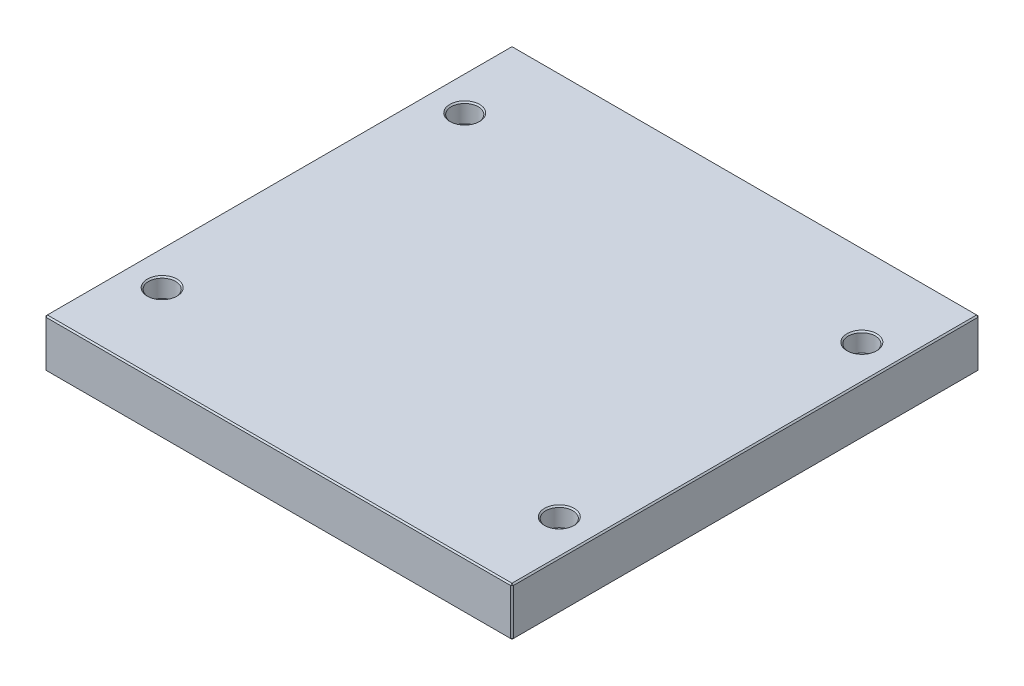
ISO-10303-21;
HEADER;
FILE_DESCRIPTION(('STEP AP214'),'2;1');
FILE_NAME('part.step','',(''),(''),'','','');
FILE_SCHEMA(('AUTOMOTIVE_DESIGN { 1 0 10303 214 1 1 1 1 }'));
ENDSEC;
DATA;
#1=APPLICATION_CONTEXT('core data for automotive mechanical design processes');
#2=APPLICATION_PROTOCOL_DEFINITION('international standard','automotive_design',2000,#1);
#3=PRODUCT_CONTEXT('',#1,'mechanical');
#4=PRODUCT('Part','Part','',(#3));
#5=PRODUCT_RELATED_PRODUCT_CATEGORY('part','',(#4));
#6=PRODUCT_DEFINITION_FORMATION('','',#4);
#7=PRODUCT_DEFINITION_CONTEXT('part definition',#1,'design');
#8=PRODUCT_DEFINITION('design','',#6,#7);
#9=PRODUCT_DEFINITION_SHAPE('','',#8);
#10=(LENGTH_UNIT() NAMED_UNIT(*) SI_UNIT(.MILLI.,.METRE.));
#11=(NAMED_UNIT(*) PLANE_ANGLE_UNIT() SI_UNIT($,.RADIAN.));
#12=(NAMED_UNIT(*) SI_UNIT($,.STERADIAN.) SOLID_ANGLE_UNIT());
#13=UNCERTAINTY_MEASURE_WITH_UNIT(LENGTH_MEASURE(1.E-05),#10,'distance_accuracy_value','');
#14=(GEOMETRIC_REPRESENTATION_CONTEXT(3) GLOBAL_UNCERTAINTY_ASSIGNED_CONTEXT((#13)) GLOBAL_UNIT_ASSIGNED_CONTEXT((#10,
#11,#12)) REPRESENTATION_CONTEXT('',''));
#15=CARTESIAN_POINT('',(0.,0.,0.));
#16=DIRECTION('',(0.,0.,1.));
#17=DIRECTION('',(1.,0.,0.));
#18=AXIS2_PLACEMENT_3D('',#15,#16,#17);
#19=CARTESIAN_POINT('',(-173.,36.,173.));
#20=DIRECTION('',(1.,0.,0.));
#21=DIRECTION('',(0.,0.,-1.));
#22=AXIS2_PLACEMENT_3D('',#19,#20,#21);
#23=PLANE('',#22);
#24=DIRECTION('',(0.,-1.,0.));
#25=VECTOR('',#24,1.);
#26=CARTESIAN_POINT('',(-173.,36.,-172.));
#27=LINE('',#26,#25);
#28=CARTESIAN_POINT('',(-173.,35.,-172.));
#29=VERTEX_POINT('',#28);
#30=CARTESIAN_POINT('',(-173.,1.,-172.));
#31=VERTEX_POINT('',#30);
#32=EDGE_CURVE('E117',#29,#31,#27,.T.);
#33=ORIENTED_EDGE('',*,*,#32,.T.);
#34=DIRECTION('',(0.,0.,1.));
#35=VECTOR('',#34,1.);
#36=CARTESIAN_POINT('',(-173.,1.,173.));
#37=LINE('',#36,#35);
#38=CARTESIAN_POINT('',(-173.,1.,172.));
#39=VERTEX_POINT('',#38);
#40=EDGE_CURVE('E112',#31,#39,#37,.T.);
#41=ORIENTED_EDGE('',*,*,#40,.T.);
#42=DIRECTION('',(0.,1.,0.));
#43=VECTOR('',#42,1.);
#44=CARTESIAN_POINT('',(-173.,36.,172.));
#45=LINE('',#44,#43);
#46=CARTESIAN_POINT('',(-173.,35.,172.));
#47=VERTEX_POINT('',#46);
#48=EDGE_CURVE('E105',#39,#47,#45,.T.);
#49=ORIENTED_EDGE('',*,*,#48,.T.);
#50=DIRECTION('',(0.,0.,-1.));
#51=VECTOR('',#50,1.);
#52=CARTESIAN_POINT('',(-173.,35.,-173.));
#53=LINE('',#52,#51);
#54=EDGE_CURVE('E109',#47,#29,#53,.T.);
#55=ORIENTED_EDGE('',*,*,#54,.T.);
#56=EDGE_LOOP('',(#33,#41,#49,#55));
#57=FACE_BOUND('',#56,.T.);
#58=ADVANCED_FACE('F16',(#57),#23,.F.);
#59=CARTESIAN_POINT('',(173.,36.,173.));
#60=DIRECTION('',(0.,0.,-1.));
#61=DIRECTION('',(-1.,0.,0.));
#62=AXIS2_PLACEMENT_3D('',#59,#60,#61);
#63=PLANE('',#62);
#64=DIRECTION('',(-1.,0.,0.));
#65=VECTOR('',#64,1.);
#66=CARTESIAN_POINT('',(-173.,35.,173.));
#67=LINE('',#66,#65);
#68=CARTESIAN_POINT('',(172.,35.,173.));
#69=VERTEX_POINT('',#68);
#70=CARTESIAN_POINT('',(-172.,35.,173.));
#71=VERTEX_POINT('',#70);
#72=EDGE_CURVE('E189',#69,#71,#67,.T.);
#73=ORIENTED_EDGE('',*,*,#72,.T.);
#74=DIRECTION('',(0.,-1.,0.));
#75=VECTOR('',#74,1.);
#76=CARTESIAN_POINT('',(-172.,36.,173.));
#77=LINE('',#76,#75);
#78=CARTESIAN_POINT('',(-172.,1.,173.));
#79=VERTEX_POINT('',#78);
#80=EDGE_CURVE('E125',#71,#79,#77,.T.);
#81=ORIENTED_EDGE('',*,*,#80,.T.);
#82=DIRECTION('',(1.,0.,0.));
#83=VECTOR('',#82,1.);
#84=CARTESIAN_POINT('',(173.,1.,173.));
#85=LINE('',#84,#83);
#86=CARTESIAN_POINT('',(172.,1.,173.));
#87=VERTEX_POINT('',#86);
#88=EDGE_CURVE('E195',#79,#87,#85,.T.);
#89=ORIENTED_EDGE('',*,*,#88,.T.);
#90=DIRECTION('',(0.,1.,0.));
#91=VECTOR('',#90,1.);
#92=CARTESIAN_POINT('',(172.,36.,173.));
#93=LINE('',#92,#91);
#94=EDGE_CURVE('E192',#87,#69,#93,.T.);
#95=ORIENTED_EDGE('',*,*,#94,.T.);
#96=EDGE_LOOP('',(#73,#81,#89,#95));
#97=FACE_BOUND('',#96,.T.);
#98=ADVANCED_FACE('F385',(#97),#63,.F.);
#99=CARTESIAN_POINT('',(173.,36.,173.));
#100=DIRECTION('',(-1.,0.,0.));
#101=DIRECTION('',(0.,0.,1.));
#102=AXIS2_PLACEMENT_3D('',#99,#100,#101);
#103=PLANE('',#102);
#104=DIRECTION('',(0.,0.,-1.));
#105=VECTOR('',#104,1.);
#106=CARTESIAN_POINT('',(173.,1.,173.));
#107=LINE('',#106,#105);
#108=CARTESIAN_POINT('',(173.,1.,172.));
#109=VERTEX_POINT('',#108);
#110=CARTESIAN_POINT('',(173.,1.,-172.));
#111=VERTEX_POINT('',#110);
#112=EDGE_CURVE('E182',#109,#111,#107,.T.);
#113=ORIENTED_EDGE('',*,*,#112,.T.);
#114=DIRECTION('',(0.,1.,0.));
#115=VECTOR('',#114,1.);
#116=CARTESIAN_POINT('',(173.,36.,-172.));
#117=LINE('',#116,#115);
#118=CARTESIAN_POINT('',(173.,35.,-172.));
#119=VERTEX_POINT('',#118);
#120=EDGE_CURVE('E185',#111,#119,#117,.T.);
#121=ORIENTED_EDGE('',*,*,#120,.T.);
#122=DIRECTION('',(0.,0.,1.));
#123=VECTOR('',#122,1.);
#124=CARTESIAN_POINT('',(173.,35.,173.));
#125=LINE('',#124,#123);
#126=CARTESIAN_POINT('',(173.,35.,172.));
#127=VERTEX_POINT('',#126);
#128=EDGE_CURVE('E176',#119,#127,#125,.T.);
#129=ORIENTED_EDGE('',*,*,#128,.T.);
#130=DIRECTION('',(0.,-1.,0.));
#131=VECTOR('',#130,1.);
#132=CARTESIAN_POINT('',(173.,36.,172.));
#133=LINE('',#132,#131);
#134=EDGE_CURVE('E179',#127,#109,#133,.T.);
#135=ORIENTED_EDGE('',*,*,#134,.T.);
#136=EDGE_LOOP('',(#113,#121,#129,#135));
#137=FACE_BOUND('',#136,.T.);
#138=ADVANCED_FACE('F389',(#137),#103,.F.);
#139=CARTESIAN_POINT('',(173.,36.,-173.));
#140=DIRECTION('',(0.,0.,1.));
#141=DIRECTION('',(1.,0.,0.));
#142=AXIS2_PLACEMENT_3D('',#139,#140,#141);
#143=PLANE('',#142);
#144=DIRECTION('',(0.,-1.,0.));
#145=VECTOR('',#144,1.);
#146=CARTESIAN_POINT('',(172.,36.,-173.));
#147=LINE('',#146,#145);
#148=CARTESIAN_POINT('',(172.,35.,-173.));
#149=VERTEX_POINT('',#148);
#150=CARTESIAN_POINT('',(172.,1.,-173.));
#151=VERTEX_POINT('',#150);
#152=EDGE_CURVE('E166',#149,#151,#147,.T.);
#153=ORIENTED_EDGE('',*,*,#152,.T.);
#154=DIRECTION('',(-1.,0.,0.));
#155=VECTOR('',#154,1.);
#156=CARTESIAN_POINT('',(173.,1.,-173.));
#157=LINE('',#156,#155);
#158=CARTESIAN_POINT('',(-172.,1.,-173.));
#159=VERTEX_POINT('',#158);
#160=EDGE_CURVE('E173',#151,#159,#157,.T.);
#161=ORIENTED_EDGE('',*,*,#160,.T.);
#162=DIRECTION('',(0.,1.,0.));
#163=VECTOR('',#162,1.);
#164=CARTESIAN_POINT('',(-172.,36.,-173.));
#165=LINE('',#164,#163);
#166=CARTESIAN_POINT('',(-172.,35.,-173.));
#167=VERTEX_POINT('',#166);
#168=EDGE_CURVE('E169',#159,#167,#165,.T.);
#169=ORIENTED_EDGE('',*,*,#168,.T.);
#170=DIRECTION('',(1.,0.,0.));
#171=VECTOR('',#170,1.);
#172=CARTESIAN_POINT('',(173.,35.,-173.));
#173=LINE('',#172,#171);
#174=EDGE_CURVE('E163',#167,#149,#173,.T.);
#175=ORIENTED_EDGE('',*,*,#174,.T.);
#176=EDGE_LOOP('',(#153,#161,#169,#175));
#177=FACE_BOUND('',#176,.T.);
#178=ADVANCED_FACE('F530',(#177),#143,.F.);
#179=CARTESIAN_POINT('',(0.,36.,0.));
#180=DIRECTION('',(0.,1.,0.));
#181=DIRECTION('',(0.,0.,1.));
#182=AXIS2_PLACEMENT_3D('',#179,#180,#181);
#183=PLANE('',#182);
#184=CARTESIAN_POINT('',(-147.,36.,112.));
#185=DIRECTION('',(0.,1.,0.));
#186=DIRECTION('',(0.,0.,1.));
#187=AXIS2_PLACEMENT_3D('',#184,#185,#186);
#188=CIRCLE('',#187,11.);
#189=CARTESIAN_POINT('',(-147.,36.,123.));
#190=VERTEX_POINT('',#189);
#191=EDGE_CURVE('E358',#190,#190,#188,.F.);
#192=ORIENTED_EDGE('',*,*,#191,.T.);
#193=EDGE_LOOP('',(#192));
#194=FACE_BOUND('',#193,.T.);
#195=CARTESIAN_POINT('',(147.,36.,112.));
#196=DIRECTION('',(0.,1.,0.));
#197=DIRECTION('',(0.,0.,1.));
#198=AXIS2_PLACEMENT_3D('',#195,#196,#197);
#199=CIRCLE('',#198,11.);
#200=CARTESIAN_POINT('',(147.,36.,123.));
#201=VERTEX_POINT('',#200);
#202=EDGE_CURVE('E354',#201,#201,#199,.F.);
#203=ORIENTED_EDGE('',*,*,#202,.T.);
#204=EDGE_LOOP('',(#203));
#205=FACE_BOUND('',#204,.T.);
#206=CARTESIAN_POINT('',(147.,36.,-112.));
#207=DIRECTION('',(0.,1.,0.));
#208=DIRECTION('',(0.,0.,1.));
#209=AXIS2_PLACEMENT_3D('',#206,#207,#208);
#210=CIRCLE('',#209,11.);
#211=CARTESIAN_POINT('',(147.,36.,-101.));
#212=VERTEX_POINT('',#211);
#213=EDGE_CURVE('E350',#212,#212,#210,.F.);
#214=ORIENTED_EDGE('',*,*,#213,.T.);
#215=EDGE_LOOP('',(#214));
#216=FACE_BOUND('',#215,.T.);
#217=CARTESIAN_POINT('',(-147.,36.,-112.));
#218=DIRECTION('',(0.,1.,0.));
#219=DIRECTION('',(0.,0.,1.));
#220=AXIS2_PLACEMENT_3D('',#217,#218,#219);
#221=CIRCLE('',#220,11.);
#222=CARTESIAN_POINT('',(-147.,36.,-101.));
#223=VERTEX_POINT('',#222);
#224=EDGE_CURVE('E346',#223,#223,#221,.F.);
#225=ORIENTED_EDGE('',*,*,#224,.T.);
#226=EDGE_LOOP('',(#225));
#227=FACE_BOUND('',#226,.T.);
#228=DIRECTION('',(0.,0.,-1.));
#229=VECTOR('',#228,1.);
#230=CARTESIAN_POINT('',(172.,36.,-173.));
#231=LINE('',#230,#229);
#232=CARTESIAN_POINT('',(172.,36.,172.));
#233=VERTEX_POINT('',#232);
#234=CARTESIAN_POINT('',(172.,36.,-172.));
#235=VERTEX_POINT('',#234);
#236=EDGE_CURVE('E32',#233,#235,#231,.T.);
#237=ORIENTED_EDGE('',*,*,#236,.T.);
#238=DIRECTION('',(-1.,0.,0.));
#239=VECTOR('',#238,1.);
#240=CARTESIAN_POINT('',(-173.,36.,-172.));
#241=LINE('',#240,#239);
#242=CARTESIAN_POINT('',(-172.,36.,-172.));
#243=VERTEX_POINT('',#242);
#244=EDGE_CURVE('E220',#235,#243,#241,.T.);
#245=ORIENTED_EDGE('',*,*,#244,.T.);
#246=DIRECTION('',(0.,0.,1.));
#247=VECTOR('',#246,1.);
#248=CARTESIAN_POINT('',(-172.,36.,173.));
#249=LINE('',#248,#247);
#250=CARTESIAN_POINT('',(-172.,36.,172.));
#251=VERTEX_POINT('',#250);
#252=EDGE_CURVE('E213',#243,#251,#249,.T.);
#253=ORIENTED_EDGE('',*,*,#252,.T.);
#254=DIRECTION('',(1.,0.,0.));
#255=VECTOR('',#254,1.);
#256=CARTESIAN_POINT('',(173.,36.,172.));
#257=LINE('',#256,#255);
#258=EDGE_CURVE('E37',#251,#233,#257,.T.);
#259=ORIENTED_EDGE('',*,*,#258,.T.);
#260=EDGE_LOOP('',(#237,#245,#253,#259));
#261=FACE_BOUND('',#260,.T.);
#262=ADVANCED_FACE('F527',(#194,#205,#216,#227,#261),#183,.T.);
#263=CARTESIAN_POINT('',(0.,0.,0.));
#264=DIRECTION('',(0.,1.,0.));
#265=DIRECTION('',(0.,0.,1.));
#266=AXIS2_PLACEMENT_3D('',#263,#264,#265);
#267=PLANE('',#266);
#268=CARTESIAN_POINT('',(147.,0.,-112.));
#269=DIRECTION('',(0.,1.,0.));
#270=DIRECTION('',(0.,0.,1.));
#271=AXIS2_PLACEMENT_3D('',#268,#269,#270);
#272=CIRCLE('',#271,8.);
#273=CARTESIAN_POINT('',(147.,0.,-104.));
#274=VERTEX_POINT('',#273);
#275=EDGE_CURVE('E322',#274,#274,#272,.T.);
#276=ORIENTED_EDGE('',*,*,#275,.T.);
#277=EDGE_LOOP('',(#276));
#278=FACE_BOUND('',#277,.T.);
#279=CARTESIAN_POINT('',(147.,0.,112.));
#280=DIRECTION('',(0.,1.,0.));
#281=DIRECTION('',(0.,0.,1.));
#282=AXIS2_PLACEMENT_3D('',#279,#280,#281);
#283=CIRCLE('',#282,8.);
#284=CARTESIAN_POINT('',(147.,0.,120.));
#285=VERTEX_POINT('',#284);
#286=EDGE_CURVE('E318',#285,#285,#283,.T.);
#287=ORIENTED_EDGE('',*,*,#286,.T.);
#288=EDGE_LOOP('',(#287));
#289=FACE_BOUND('',#288,.T.);
#290=CARTESIAN_POINT('',(-147.,0.,112.));
#291=DIRECTION('',(0.,1.,0.));
#292=DIRECTION('',(0.,0.,1.));
#293=AXIS2_PLACEMENT_3D('',#290,#291,#292);
#294=CIRCLE('',#293,8.);
#295=CARTESIAN_POINT('',(-147.,0.,120.));
#296=VERTEX_POINT('',#295);
#297=EDGE_CURVE('E314',#296,#296,#294,.T.);
#298=ORIENTED_EDGE('',*,*,#297,.T.);
#299=EDGE_LOOP('',(#298));
#300=FACE_BOUND('',#299,.T.);
#301=CARTESIAN_POINT('',(-147.,0.,-112.));
#302=DIRECTION('',(0.,1.,0.));
#303=DIRECTION('',(0.,0.,1.));
#304=AXIS2_PLACEMENT_3D('',#301,#302,#303);
#305=CIRCLE('',#304,8.);
#306=CARTESIAN_POINT('',(-147.,0.,-104.));
#307=VERTEX_POINT('',#306);
#308=EDGE_CURVE('E223',#307,#307,#305,.T.);
#309=ORIENTED_EDGE('',*,*,#308,.T.);
#310=EDGE_LOOP('',(#309));
#311=FACE_BOUND('',#310,.T.);
#312=DIRECTION('',(0.,0.,1.));
#313=VECTOR('',#312,1.);
#314=CARTESIAN_POINT('',(172.,0.,0.));
#315=LINE('',#314,#313);
#316=CARTESIAN_POINT('',(172.,0.,-172.));
#317=VERTEX_POINT('',#316);
#318=CARTESIAN_POINT('',(172.,0.,172.));
#319=VERTEX_POINT('',#318);
#320=EDGE_CURVE('E200',#317,#319,#315,.T.);
#321=ORIENTED_EDGE('',*,*,#320,.T.);
#322=DIRECTION('',(-1.,0.,0.));
#323=VECTOR('',#322,1.);
#324=CARTESIAN_POINT('',(0.,0.,172.));
#325=LINE('',#324,#323);
#326=CARTESIAN_POINT('',(-172.,0.,172.));
#327=VERTEX_POINT('',#326);
#328=EDGE_CURVE('E209',#319,#327,#325,.T.);
#329=ORIENTED_EDGE('',*,*,#328,.T.);
#330=DIRECTION('',(0.,0.,-1.));
#331=VECTOR('',#330,1.);
#332=CARTESIAN_POINT('',(-172.,0.,0.));
#333=LINE('',#332,#331);
#334=CARTESIAN_POINT('',(-172.,0.,-172.));
#335=VERTEX_POINT('',#334);
#336=EDGE_CURVE('E206',#327,#335,#333,.T.);
#337=ORIENTED_EDGE('',*,*,#336,.T.);
#338=DIRECTION('',(1.,0.,0.));
#339=VECTOR('',#338,1.);
#340=CARTESIAN_POINT('',(0.,0.,-172.));
#341=LINE('',#340,#339);
#342=EDGE_CURVE('E203',#335,#317,#341,.T.);
#343=ORIENTED_EDGE('',*,*,#342,.T.);
#344=EDGE_LOOP('',(#321,#329,#337,#343));
#345=FACE_BOUND('',#344,.T.);
#346=ADVANCED_FACE('F468',(#278,#289,#300,#311,#345),#267,.F.);
#347=CARTESIAN_POINT('',(173.,36.,172.));
#348=DIRECTION('',(-0.707106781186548,0.,-0.707106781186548));
#349=DIRECTION('',(0.,-1.,0.));
#350=AXIS2_PLACEMENT_3D('',#347,#348,#349);
#351=PLANE('',#350);
#352=DIRECTION('',(-0.707106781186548,0.,0.707106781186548));
#353=VECTOR('',#352,1.);
#354=CARTESIAN_POINT('',(172.,35.,173.));
#355=LINE('',#354,#353);
#356=EDGE_CURVE('E146',#69,#127,#355,.F.);
#357=ORIENTED_EDGE('',*,*,#356,.F.);
#358=ORIENTED_EDGE('',*,*,#94,.F.);
#359=DIRECTION('',(0.707106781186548,0.,-0.707106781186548));
#360=VECTOR('',#359,1.);
#361=CARTESIAN_POINT('',(172.,1.,173.));
#362=LINE('',#361,#360);
#363=EDGE_CURVE('E153',#109,#87,#362,.F.);
#364=ORIENTED_EDGE('',*,*,#363,.F.);
#365=ORIENTED_EDGE('',*,*,#134,.F.);
#366=EDGE_LOOP('',(#357,#358,#364,#365));
#367=FACE_BOUND('',#366,.T.);
#368=ADVANCED_FACE('F464',(#367),#351,.F.);
#369=CARTESIAN_POINT('',(172.,35.,173.));
#370=DIRECTION('',(0.57735026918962,0.577350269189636,0.57735026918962));
#371=DIRECTION('',(0.,-0.707106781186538,0.707106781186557));
#372=AXIS2_PLACEMENT_3D('',#369,#370,#371);
#373=PLANE('',#372);
#374=DIRECTION('',(0.,-0.707106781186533,0.707106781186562));
#375=VECTOR('',#374,1.);
#376=CARTESIAN_POINT('',(172.,35.,173.));
#377=LINE('',#376,#375);
#378=EDGE_CURVE('E284',#69,#233,#377,.F.);
#379=ORIENTED_EDGE('',*,*,#378,.F.);
#380=ORIENTED_EDGE('',*,*,#356,.T.);
#381=DIRECTION('',(-0.707106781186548,0.707106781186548,0.));
#382=VECTOR('',#381,1.);
#383=CARTESIAN_POINT('',(172.5,35.5,172.));
#384=LINE('',#383,#382);
#385=EDGE_CURVE('E287',#233,#127,#384,.F.);
#386=ORIENTED_EDGE('',*,*,#385,.F.);
#387=EDGE_LOOP('',(#379,#380,#386));
#388=FACE_BOUND('',#387,.T.);
#389=ADVANCED_FACE('F460',(#388),#373,.T.);
#390=CARTESIAN_POINT('',(172.,1.,173.));
#391=DIRECTION('',(0.57735026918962,-0.577350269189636,0.57735026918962));
#392=DIRECTION('',(0.,-0.707106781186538,-0.707106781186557));
#393=AXIS2_PLACEMENT_3D('',#390,#391,#392);
#394=PLANE('',#393);
#395=DIRECTION('',(-0.707106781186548,-0.707106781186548,0.));
#396=VECTOR('',#395,1.);
#397=CARTESIAN_POINT('',(172.5,0.500000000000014,172.));
#398=LINE('',#397,#396);
#399=EDGE_CURVE('E276',#109,#319,#398,.T.);
#400=ORIENTED_EDGE('',*,*,#399,.F.);
#401=ORIENTED_EDGE('',*,*,#363,.T.);
#402=DIRECTION('',(0.,0.707106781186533,0.707106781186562));
#403=VECTOR('',#402,1.);
#404=CARTESIAN_POINT('',(172.,1.,173.));
#405=LINE('',#404,#403);
#406=EDGE_CURVE('E280',#319,#87,#405,.T.);
#407=ORIENTED_EDGE('',*,*,#406,.F.);
#408=EDGE_LOOP('',(#400,#401,#407));
#409=FACE_BOUND('',#408,.T.);
#410=ADVANCED_FACE('F456',(#409),#394,.T.);
#411=CARTESIAN_POINT('',(172.,36.,0.));
#412=DIRECTION('',(0.707106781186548,0.707106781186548,0.));
#413=DIRECTION('',(0.,0.,1.));
#414=AXIS2_PLACEMENT_3D('',#411,#412,#413);
#415=PLANE('',#414);
#416=ORIENTED_EDGE('',*,*,#385,.T.);
#417=ORIENTED_EDGE('',*,*,#128,.F.);
#418=DIRECTION('',(0.707106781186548,-0.707106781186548,0.));
#419=VECTOR('',#418,1.);
#420=CARTESIAN_POINT('',(173.,35.,-172.));
#421=LINE('',#420,#419);
#422=EDGE_CURVE('E269',#235,#119,#421,.T.);
#423=ORIENTED_EDGE('',*,*,#422,.F.);
#424=ORIENTED_EDGE('',*,*,#236,.F.);
#425=EDGE_LOOP('',(#416,#417,#423,#424));
#426=FACE_BOUND('',#425,.T.);
#427=ADVANCED_FACE('F452',(#426),#415,.T.);
#428=CARTESIAN_POINT('',(0.,36.,172.));
#429=DIRECTION('',(0.,0.707106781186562,0.707106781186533));
#430=DIRECTION('',(-1.,0.,0.));
#431=AXIS2_PLACEMENT_3D('',#428,#429,#430);
#432=PLANE('',#431);
#433=ORIENTED_EDGE('',*,*,#378,.T.);
#434=ORIENTED_EDGE('',*,*,#258,.F.);
#435=DIRECTION('',(0.,0.707106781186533,-0.707106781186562));
#436=VECTOR('',#435,1.);
#437=CARTESIAN_POINT('',(-172.,35.5,172.5));
#438=LINE('',#437,#436);
#439=EDGE_CURVE('E130',#71,#251,#438,.T.);
#440=ORIENTED_EDGE('',*,*,#439,.F.);
#441=ORIENTED_EDGE('',*,*,#72,.F.);
#442=EDGE_LOOP('',(#433,#434,#440,#441));
#443=FACE_BOUND('',#442,.T.);
#444=ADVANCED_FACE('F449',(#443),#432,.T.);
#445=CARTESIAN_POINT('',(-172.,36.,173.));
#446=DIRECTION('',(0.707106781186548,0.,-0.707106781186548));
#447=DIRECTION('',(0.,-1.,0.));
#448=AXIS2_PLACEMENT_3D('',#445,#446,#447);
#449=PLANE('',#448);
#450=DIRECTION('',(0.707106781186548,0.,0.707106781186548));
#451=VECTOR('',#450,1.);
#452=CARTESIAN_POINT('',(-172.,1.,173.));
#453=LINE('',#452,#451);
#454=EDGE_CURVE('E131',#79,#39,#453,.F.);
#455=ORIENTED_EDGE('',*,*,#454,.F.);
#456=ORIENTED_EDGE('',*,*,#80,.F.);
#457=DIRECTION('',(-0.707106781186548,0.,-0.707106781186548));
#458=VECTOR('',#457,1.);
#459=CARTESIAN_POINT('',(-173.,35.,172.));
#460=LINE('',#459,#458);
#461=EDGE_CURVE('E121',#47,#71,#460,.F.);
#462=ORIENTED_EDGE('',*,*,#461,.F.);
#463=ORIENTED_EDGE('',*,*,#48,.F.);
#464=EDGE_LOOP('',(#455,#456,#462,#463));
#465=FACE_BOUND('',#464,.T.);
#466=ADVANCED_FACE('F123',(#465),#449,.F.);
#467=CARTESIAN_POINT('',(173.,1.,173.));
#468=DIRECTION('',(0.,0.707106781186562,-0.707106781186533));
#469=DIRECTION('',(1.,0.,0.));
#470=AXIS2_PLACEMENT_3D('',#467,#468,#469);
#471=PLANE('',#470);
#472=ORIENTED_EDGE('',*,*,#406,.T.);
#473=ORIENTED_EDGE('',*,*,#88,.F.);
#474=DIRECTION('',(0.,-0.707106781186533,-0.707106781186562));
#475=VECTOR('',#474,1.);
#476=CARTESIAN_POINT('',(-172.,1.,173.));
#477=LINE('',#476,#475);
#478=EDGE_CURVE('E262',#327,#79,#477,.F.);
#479=ORIENTED_EDGE('',*,*,#478,.F.);
#480=ORIENTED_EDGE('',*,*,#328,.F.);
#481=EDGE_LOOP('',(#472,#473,#479,#480));
#482=FACE_BOUND('',#481,.T.);
#483=ADVANCED_FACE('F442',(#482),#471,.F.);
#484=CARTESIAN_POINT('',(173.,1.,173.));
#485=DIRECTION('',(-0.707106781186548,0.707106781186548,0.));
#486=DIRECTION('',(0.,0.,-1.));
#487=AXIS2_PLACEMENT_3D('',#484,#485,#486);
#488=PLANE('',#487);
#489=ORIENTED_EDGE('',*,*,#399,.T.);
#490=ORIENTED_EDGE('',*,*,#320,.F.);
#491=DIRECTION('',(0.707106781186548,0.707106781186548,0.));
#492=VECTOR('',#491,1.);
#493=CARTESIAN_POINT('',(172.5,0.499999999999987,-172.));
#494=LINE('',#493,#492);
#495=EDGE_CURVE('E258',#111,#317,#494,.F.);
#496=ORIENTED_EDGE('',*,*,#495,.F.);
#497=ORIENTED_EDGE('',*,*,#112,.F.);
#498=EDGE_LOOP('',(#489,#490,#496,#497));
#499=FACE_BOUND('',#498,.T.);
#500=ADVANCED_FACE('F438',(#499),#488,.F.);
#501=CARTESIAN_POINT('',(172.,36.,-173.));
#502=DIRECTION('',(-0.707106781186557,0.,0.707106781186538));
#503=DIRECTION('',(0.,-1.,0.));
#504=AXIS2_PLACEMENT_3D('',#501,#502,#503);
#505=PLANE('',#504);
#506=DIRECTION('',(0.707106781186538,0.,0.707106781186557));
#507=VECTOR('',#506,1.);
#508=CARTESIAN_POINT('',(173.,35.,-172.));
#509=LINE('',#508,#507);
#510=EDGE_CURVE('E272',#119,#149,#509,.F.);
#511=ORIENTED_EDGE('',*,*,#510,.F.);
#512=ORIENTED_EDGE('',*,*,#120,.F.);
#513=DIRECTION('',(-0.707106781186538,0.,-0.707106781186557));
#514=VECTOR('',#513,1.);
#515=CARTESIAN_POINT('',(172.,1.,-173.));
#516=LINE('',#515,#514);
#517=EDGE_CURVE('E254',#151,#111,#516,.F.);
#518=ORIENTED_EDGE('',*,*,#517,.F.);
#519=ORIENTED_EDGE('',*,*,#152,.F.);
#520=EDGE_LOOP('',(#511,#512,#518,#519));
#521=FACE_BOUND('',#520,.T.);
#522=ADVANCED_FACE('F434',(#521),#505,.F.);
#523=CARTESIAN_POINT('',(173.,35.,-172.));
#524=DIRECTION('',(0.577350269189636,0.57735026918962,-0.57735026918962));
#525=DIRECTION('',(-0.707106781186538,0.,-0.707106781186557));
#526=AXIS2_PLACEMENT_3D('',#523,#524,#525);
#527=PLANE('',#526);
#528=ORIENTED_EDGE('',*,*,#422,.T.);
#529=ORIENTED_EDGE('',*,*,#510,.T.);
#530=DIRECTION('',(0.,0.707106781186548,0.707106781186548));
#531=VECTOR('',#530,1.);
#532=CARTESIAN_POINT('',(172.,35.5,-172.5));
#533=LINE('',#532,#531);
#534=EDGE_CURVE('E139',#235,#149,#533,.F.);
#535=ORIENTED_EDGE('',*,*,#534,.F.);
#536=EDGE_LOOP('',(#528,#529,#535));
#537=FACE_BOUND('',#536,.T.);
#538=ADVANCED_FACE('F431',(#537),#527,.T.);
#539=CARTESIAN_POINT('',(-173.,35.,172.));
#540=DIRECTION('',(-0.57735026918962,0.577350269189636,0.57735026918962));
#541=DIRECTION('',(0.,-0.707106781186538,0.707106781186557));
#542=AXIS2_PLACEMENT_3D('',#539,#540,#541);
#543=PLANE('',#542);
#544=ORIENTED_EDGE('',*,*,#461,.T.);
#545=ORIENTED_EDGE('',*,*,#439,.T.);
#546=DIRECTION('',(-0.707106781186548,-0.707106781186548,0.));
#547=VECTOR('',#546,1.);
#548=CARTESIAN_POINT('',(-173.,35.,172.));
#549=LINE('',#548,#547);
#550=EDGE_CURVE('E134',#47,#251,#549,.F.);
#551=ORIENTED_EDGE('',*,*,#550,.F.);
#552=EDGE_LOOP('',(#544,#545,#551));
#553=FACE_BOUND('',#552,.T.);
#554=ADVANCED_FACE('F135',(#553),#543,.T.);
#555=CARTESIAN_POINT('',(-172.,1.,173.));
#556=DIRECTION('',(-0.57735026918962,-0.577350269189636,0.57735026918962));
#557=DIRECTION('',(0.,-0.707106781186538,-0.707106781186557));
#558=AXIS2_PLACEMENT_3D('',#555,#556,#557);
#559=PLANE('',#558);
#560=ORIENTED_EDGE('',*,*,#478,.T.);
#561=ORIENTED_EDGE('',*,*,#454,.T.);
#562=DIRECTION('',(-0.707106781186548,0.707106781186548,0.));
#563=VECTOR('',#562,1.);
#564=CARTESIAN_POINT('',(-172.5,0.500000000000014,172.));
#565=LINE('',#564,#563);
#566=EDGE_CURVE('E140',#327,#39,#565,.T.);
#567=ORIENTED_EDGE('',*,*,#566,.F.);
#568=EDGE_LOOP('',(#560,#561,#567));
#569=FACE_BOUND('',#568,.T.);
#570=ADVANCED_FACE('F424',(#569),#559,.T.);
#571=CARTESIAN_POINT('',(172.,1.,-173.));
#572=DIRECTION('',(0.577350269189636,-0.57735026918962,-0.57735026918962));
#573=DIRECTION('',(-0.707106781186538,0.,-0.707106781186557));
#574=AXIS2_PLACEMENT_3D('',#571,#572,#573);
#575=PLANE('',#574);
#576=ORIENTED_EDGE('',*,*,#517,.T.);
#577=ORIENTED_EDGE('',*,*,#495,.T.);
#578=DIRECTION('',(0.,-0.707106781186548,0.707106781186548));
#579=VECTOR('',#578,1.);
#580=CARTESIAN_POINT('',(172.,1.,-173.));
#581=LINE('',#580,#579);
#582=EDGE_CURVE('E244',#151,#317,#581,.T.);
#583=ORIENTED_EDGE('',*,*,#582,.F.);
#584=EDGE_LOOP('',(#576,#577,#583));
#585=FACE_BOUND('',#584,.T.);
#586=ADVANCED_FACE('F420',(#585),#575,.T.);
#587=CARTESIAN_POINT('',(0.,36.,-172.));
#588=DIRECTION('',(0.,0.707106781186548,-0.707106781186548));
#589=DIRECTION('',(1.,0.,0.));
#590=AXIS2_PLACEMENT_3D('',#587,#588,#589);
#591=PLANE('',#590);
#592=ORIENTED_EDGE('',*,*,#534,.T.);
#593=ORIENTED_EDGE('',*,*,#174,.F.);
#594=DIRECTION('',(0.,-0.707106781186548,-0.707106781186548));
#595=VECTOR('',#594,1.);
#596=CARTESIAN_POINT('',(-172.,35.,-173.));
#597=LINE('',#596,#595);
#598=EDGE_CURVE('E240',#243,#167,#597,.T.);
#599=ORIENTED_EDGE('',*,*,#598,.F.);
#600=ORIENTED_EDGE('',*,*,#244,.F.);
#601=EDGE_LOOP('',(#592,#593,#599,#600));
#602=FACE_BOUND('',#601,.T.);
#603=ADVANCED_FACE('F417',(#602),#591,.T.);
#604=CARTESIAN_POINT('',(-172.,36.,0.));
#605=DIRECTION('',(-0.707106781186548,0.707106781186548,0.));
#606=DIRECTION('',(0.,0.,-1.));
#607=AXIS2_PLACEMENT_3D('',#604,#605,#606);
#608=PLANE('',#607);
#609=ORIENTED_EDGE('',*,*,#550,.T.);
#610=ORIENTED_EDGE('',*,*,#252,.F.);
#611=DIRECTION('',(0.707106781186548,0.707106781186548,0.));
#612=VECTOR('',#611,1.);
#613=CARTESIAN_POINT('',(-172.5,35.5,-172.));
#614=LINE('',#613,#612);
#615=EDGE_CURVE('E143',#29,#243,#614,.T.);
#616=ORIENTED_EDGE('',*,*,#615,.F.);
#617=ORIENTED_EDGE('',*,*,#54,.F.);
#618=EDGE_LOOP('',(#609,#610,#616,#617));
#619=FACE_BOUND('',#618,.T.);
#620=ADVANCED_FACE('F142',(#619),#608,.T.);
#621=CARTESIAN_POINT('',(-173.,1.,173.));
#622=DIRECTION('',(0.707106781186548,0.707106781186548,0.));
#623=DIRECTION('',(0.,0.,1.));
#624=AXIS2_PLACEMENT_3D('',#621,#622,#623);
#625=PLANE('',#624);
#626=ORIENTED_EDGE('',*,*,#566,.T.);
#627=ORIENTED_EDGE('',*,*,#40,.F.);
#628=DIRECTION('',(0.707106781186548,-0.707106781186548,0.));
#629=VECTOR('',#628,1.);
#630=CARTESIAN_POINT('',(-173.,1.,-172.));
#631=LINE('',#630,#629);
#632=EDGE_CURVE('E234',#335,#31,#631,.F.);
#633=ORIENTED_EDGE('',*,*,#632,.F.);
#634=ORIENTED_EDGE('',*,*,#336,.F.);
#635=EDGE_LOOP('',(#626,#627,#633,#634));
#636=FACE_BOUND('',#635,.T.);
#637=ADVANCED_FACE('F410',(#636),#625,.F.);
#638=CARTESIAN_POINT('',(173.,1.,-173.));
#639=DIRECTION('',(0.,0.707106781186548,0.707106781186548));
#640=DIRECTION('',(-1.,0.,0.));
#641=AXIS2_PLACEMENT_3D('',#638,#639,#640);
#642=PLANE('',#641);
#643=ORIENTED_EDGE('',*,*,#582,.T.);
#644=ORIENTED_EDGE('',*,*,#342,.F.);
#645=DIRECTION('',(0.,0.707106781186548,-0.707106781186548));
#646=VECTOR('',#645,1.);
#647=CARTESIAN_POINT('',(-172.,0.5,-172.5));
#648=LINE('',#647,#646);
#649=EDGE_CURVE('E230',#159,#335,#648,.F.);
#650=ORIENTED_EDGE('',*,*,#649,.F.);
#651=ORIENTED_EDGE('',*,*,#160,.F.);
#652=EDGE_LOOP('',(#643,#644,#650,#651));
#653=FACE_BOUND('',#652,.T.);
#654=ADVANCED_FACE('F406',(#653),#642,.F.);
#655=CARTESIAN_POINT('',(-172.,35.,-173.));
#656=DIRECTION('',(-0.577350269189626,0.577350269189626,-0.577350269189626));
#657=DIRECTION('',(-0.707106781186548,0.,0.707106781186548));
#658=AXIS2_PLACEMENT_3D('',#655,#656,#657);
#659=PLANE('',#658);
#660=ORIENTED_EDGE('',*,*,#615,.T.);
#661=ORIENTED_EDGE('',*,*,#598,.T.);
#662=DIRECTION('',(0.707106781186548,0.,-0.707106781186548));
#663=VECTOR('',#662,1.);
#664=CARTESIAN_POINT('',(-172.,35.,-173.));
#665=LINE('',#664,#663);
#666=EDGE_CURVE('E227',#29,#167,#665,.T.);
#667=ORIENTED_EDGE('',*,*,#666,.F.);
#668=EDGE_LOOP('',(#660,#661,#667));
#669=FACE_BOUND('',#668,.T.);
#670=ADVANCED_FACE('F402',(#669),#659,.T.);
#671=CARTESIAN_POINT('',(-173.,1.,-172.));
#672=DIRECTION('',(-0.577350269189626,-0.577350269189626,-0.577350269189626));
#673=DIRECTION('',(-0.707106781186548,0.,0.707106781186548));
#674=AXIS2_PLACEMENT_3D('',#671,#672,#673);
#675=PLANE('',#674);
#676=ORIENTED_EDGE('',*,*,#649,.T.);
#677=ORIENTED_EDGE('',*,*,#632,.T.);
#678=DIRECTION('',(-0.707106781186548,0.,0.707106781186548));
#679=VECTOR('',#678,1.);
#680=CARTESIAN_POINT('',(-173.,1.,-172.));
#681=LINE('',#680,#679);
#682=EDGE_CURVE('E224',#159,#31,#681,.T.);
#683=ORIENTED_EDGE('',*,*,#682,.F.);
#684=EDGE_LOOP('',(#676,#677,#683));
#685=FACE_BOUND('',#684,.T.);
#686=ADVANCED_FACE('F398',(#685),#675,.T.);
#687=CARTESIAN_POINT('',(-173.,36.,-172.));
#688=DIRECTION('',(0.707106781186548,0.,0.707106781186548));
#689=DIRECTION('',(0.,-1.,0.));
#690=AXIS2_PLACEMENT_3D('',#687,#688,#689);
#691=PLANE('',#690);
#692=ORIENTED_EDGE('',*,*,#666,.T.);
#693=ORIENTED_EDGE('',*,*,#168,.F.);
#694=ORIENTED_EDGE('',*,*,#682,.T.);
#695=ORIENTED_EDGE('',*,*,#32,.F.);
#696=EDGE_LOOP('',(#692,#693,#694,#695));
#697=FACE_BOUND('',#696,.T.);
#698=ADVANCED_FACE('F394',(#697),#691,.F.);
#699=CARTESIAN_POINT('',(-147.,22.,-112.));
#700=DIRECTION('',(0.,1.,0.));
#701=DIRECTION('',(0.,0.,1.));
#702=AXIS2_PLACEMENT_3D('',#699,#700,#701);
#703=CYLINDRICAL_SURFACE('',#702,10.);
#704=CARTESIAN_POINT('',(-147.,35.,-112.));
#705=DIRECTION('',(0.,1.,0.));
#706=DIRECTION('',(0.,0.,1.));
#707=AXIS2_PLACEMENT_3D('',#704,#705,#706);
#708=CIRCLE('',#707,10.);
#709=CARTESIAN_POINT('',(-147.,35.,-102.));
#710=VERTEX_POINT('',#709);
#711=EDGE_CURVE('E10',#710,#710,#708,.T.);
#712=ORIENTED_EDGE('',*,*,#711,.T.);
#713=EDGE_LOOP('',(#712));
#714=FACE_BOUND('',#713,.T.);
#715=CARTESIAN_POINT('',(-147.,22.,-112.));
#716=DIRECTION('',(0.,1.,0.));
#717=DIRECTION('',(0.,0.,1.));
#718=AXIS2_PLACEMENT_3D('',#715,#716,#717);
#719=CIRCLE('',#718,10.);
#720=CARTESIAN_POINT('',(-147.,22.,-102.));
#721=VERTEX_POINT('',#720);
#722=EDGE_CURVE('E156',#721,#721,#719,.T.);
#723=ORIENTED_EDGE('',*,*,#722,.F.);
#724=EDGE_LOOP('',(#723));
#725=FACE_BOUND('',#724,.T.);
#726=ADVANCED_FACE('F397',(#714,#725),#703,.F.);
#727=CARTESIAN_POINT('',(-147.,22.,-112.));
#728=DIRECTION('',(0.,1.,0.));
#729=DIRECTION('',(0.,0.,1.));
#730=AXIS2_PLACEMENT_3D('',#727,#728,#729);
#731=PLANE('',#730);
#732=CARTESIAN_POINT('',(-147.,22.,-112.));
#733=DIRECTION('',(0.,1.,0.));
#734=DIRECTION('',(0.,0.,1.));
#735=AXIS2_PLACEMENT_3D('',#732,#733,#734);
#736=CIRCLE('',#735,7.);
#737=CARTESIAN_POINT('',(-147.,22.,-105.));
#738=VERTEX_POINT('',#737);
#739=EDGE_CURVE('E306',#738,#738,#736,.T.);
#740=ORIENTED_EDGE('',*,*,#739,.F.);
#741=EDGE_LOOP('',(#740));
#742=FACE_BOUND('',#741,.T.);
#743=ORIENTED_EDGE('',*,*,#722,.T.);
#744=EDGE_LOOP('',(#743));
#745=FACE_BOUND('',#744,.T.);
#746=ADVANCED_FACE('F517',(#742,#745),#731,.T.);
#747=CARTESIAN_POINT('',(147.,22.,-112.));
#748=DIRECTION('',(0.,1.,0.));
#749=DIRECTION('',(0.,0.,1.));
#750=AXIS2_PLACEMENT_3D('',#747,#748,#749);
#751=CYLINDRICAL_SURFACE('',#750,10.);
#752=CARTESIAN_POINT('',(147.,35.,-112.));
#753=DIRECTION('',(0.,1.,0.));
#754=DIRECTION('',(0.,0.,1.));
#755=AXIS2_PLACEMENT_3D('',#752,#753,#754);
#756=CIRCLE('',#755,10.);
#757=CARTESIAN_POINT('',(147.,35.,-102.));
#758=VERTEX_POINT('',#757);
#759=EDGE_CURVE('E25',#758,#758,#756,.T.);
#760=ORIENTED_EDGE('',*,*,#759,.T.);
#761=EDGE_LOOP('',(#760));
#762=FACE_BOUND('',#761,.T.);
#763=CARTESIAN_POINT('',(147.,22.,-112.));
#764=DIRECTION('',(0.,1.,0.));
#765=DIRECTION('',(0.,0.,1.));
#766=AXIS2_PLACEMENT_3D('',#763,#764,#765);
#767=CIRCLE('',#766,10.);
#768=CARTESIAN_POINT('',(147.,22.,-102.));
#769=VERTEX_POINT('',#768);
#770=EDGE_CURVE('E507',#769,#769,#767,.T.);
#771=ORIENTED_EDGE('',*,*,#770,.F.);
#772=EDGE_LOOP('',(#771));
#773=FACE_BOUND('',#772,.T.);
#774=ADVANCED_FACE('F368',(#762,#773),#751,.F.);
#775=CARTESIAN_POINT('',(147.,22.,-112.));
#776=DIRECTION('',(0.,1.,0.));
#777=DIRECTION('',(0.,0.,1.));
#778=AXIS2_PLACEMENT_3D('',#775,#776,#777);
#779=PLANE('',#778);
#780=CARTESIAN_POINT('',(147.,22.,-112.));
#781=DIRECTION('',(0.,1.,0.));
#782=DIRECTION('',(0.,0.,1.));
#783=AXIS2_PLACEMENT_3D('',#780,#781,#782);
#784=CIRCLE('',#783,7.);
#785=CARTESIAN_POINT('',(147.,22.,-105.));
#786=VERTEX_POINT('',#785);
#787=EDGE_CURVE('E302',#786,#786,#784,.T.);
#788=ORIENTED_EDGE('',*,*,#787,.F.);
#789=EDGE_LOOP('',(#788));
#790=FACE_BOUND('',#789,.T.);
#791=ORIENTED_EDGE('',*,*,#770,.T.);
#792=EDGE_LOOP('',(#791));
#793=FACE_BOUND('',#792,.T.);
#794=ADVANCED_FACE('F697',(#790,#793),#779,.T.);
#795=CARTESIAN_POINT('',(147.,22.,112.));
#796=DIRECTION('',(0.,1.,0.));
#797=DIRECTION('',(0.,0.,1.));
#798=AXIS2_PLACEMENT_3D('',#795,#796,#797);
#799=CYLINDRICAL_SURFACE('',#798,10.);
#800=CARTESIAN_POINT('',(147.,35.,112.));
#801=DIRECTION('',(0.,1.,0.));
#802=DIRECTION('',(0.,0.,1.));
#803=AXIS2_PLACEMENT_3D('',#800,#801,#802);
#804=CIRCLE('',#803,10.);
#805=CARTESIAN_POINT('',(147.,35.,122.));
#806=VERTEX_POINT('',#805);
#807=EDGE_CURVE('E361',#806,#806,#804,.T.);
#808=ORIENTED_EDGE('',*,*,#807,.T.);
#809=EDGE_LOOP('',(#808));
#810=FACE_BOUND('',#809,.T.);
#811=CARTESIAN_POINT('',(147.,22.,112.));
#812=DIRECTION('',(0.,1.,0.));
#813=DIRECTION('',(0.,0.,1.));
#814=AXIS2_PLACEMENT_3D('',#811,#812,#813);
#815=CIRCLE('',#814,10.);
#816=CARTESIAN_POINT('',(147.,22.,122.));
#817=VERTEX_POINT('',#816);
#818=EDGE_CURVE('E504',#817,#817,#815,.T.);
#819=ORIENTED_EDGE('',*,*,#818,.F.);
#820=EDGE_LOOP('',(#819));
#821=FACE_BOUND('',#820,.T.);
#822=ADVANCED_FACE('F708',(#810,#821),#799,.F.);
#823=CARTESIAN_POINT('',(147.,22.,112.));
#824=DIRECTION('',(0.,1.,0.));
#825=DIRECTION('',(0.,0.,1.));
#826=AXIS2_PLACEMENT_3D('',#823,#824,#825);
#827=PLANE('',#826);
#828=CARTESIAN_POINT('',(147.,22.,112.));
#829=DIRECTION('',(0.,1.,0.));
#830=DIRECTION('',(0.,0.,1.));
#831=AXIS2_PLACEMENT_3D('',#828,#829,#830);
#832=CIRCLE('',#831,7.);
#833=CARTESIAN_POINT('',(147.,22.,119.));
#834=VERTEX_POINT('',#833);
#835=EDGE_CURVE('E298',#834,#834,#832,.T.);
#836=ORIENTED_EDGE('',*,*,#835,.F.);
#837=EDGE_LOOP('',(#836));
#838=FACE_BOUND('',#837,.T.);
#839=ORIENTED_EDGE('',*,*,#818,.T.);
#840=EDGE_LOOP('',(#839));
#841=FACE_BOUND('',#840,.T.);
#842=ADVANCED_FACE('F498',(#838,#841),#827,.T.);
#843=CARTESIAN_POINT('',(-147.,22.,112.));
#844=DIRECTION('',(0.,1.,0.));
#845=DIRECTION('',(0.,0.,1.));
#846=AXIS2_PLACEMENT_3D('',#843,#844,#845);
#847=CYLINDRICAL_SURFACE('',#846,10.);
#848=CARTESIAN_POINT('',(-147.,35.,112.));
#849=DIRECTION('',(0.,1.,0.));
#850=DIRECTION('',(0.,0.,1.));
#851=AXIS2_PLACEMENT_3D('',#848,#849,#850);
#852=CIRCLE('',#851,10.);
#853=CARTESIAN_POINT('',(-147.,35.,122.));
#854=VERTEX_POINT('',#853);
#855=EDGE_CURVE('E342',#854,#854,#852,.T.);
#856=ORIENTED_EDGE('',*,*,#855,.T.);
#857=EDGE_LOOP('',(#856));
#858=FACE_BOUND('',#857,.T.);
#859=CARTESIAN_POINT('',(-147.,22.,112.));
#860=DIRECTION('',(0.,1.,0.));
#861=DIRECTION('',(0.,0.,1.));
#862=AXIS2_PLACEMENT_3D('',#859,#860,#861);
#863=CIRCLE('',#862,10.);
#864=CARTESIAN_POINT('',(-147.,22.,122.));
#865=VERTEX_POINT('',#864);
#866=EDGE_CURVE('E310',#865,#865,#863,.T.);
#867=ORIENTED_EDGE('',*,*,#866,.F.);
#868=EDGE_LOOP('',(#867));
#869=FACE_BOUND('',#868,.T.);
#870=ADVANCED_FACE('F494',(#858,#869),#847,.F.);
#871=CARTESIAN_POINT('',(-147.,22.,112.));
#872=DIRECTION('',(0.,1.,0.));
#873=DIRECTION('',(0.,0.,1.));
#874=AXIS2_PLACEMENT_3D('',#871,#872,#873);
#875=PLANE('',#874);
#876=CARTESIAN_POINT('',(-147.,22.,112.));
#877=DIRECTION('',(0.,1.,0.));
#878=DIRECTION('',(0.,0.,1.));
#879=AXIS2_PLACEMENT_3D('',#876,#877,#878);
#880=CIRCLE('',#879,7.);
#881=CARTESIAN_POINT('',(-147.,22.,119.));
#882=VERTEX_POINT('',#881);
#883=EDGE_CURVE('E294',#882,#882,#880,.T.);
#884=ORIENTED_EDGE('',*,*,#883,.F.);
#885=EDGE_LOOP('',(#884));
#886=FACE_BOUND('',#885,.T.);
#887=ORIENTED_EDGE('',*,*,#866,.T.);
#888=EDGE_LOOP('',(#887));
#889=FACE_BOUND('',#888,.T.);
#890=ADVANCED_FACE('F497',(#886,#889),#875,.T.);
#891=CARTESIAN_POINT('',(-147.,0.,112.));
#892=DIRECTION('',(0.,1.,0.));
#893=DIRECTION('',(0.,0.,1.));
#894=AXIS2_PLACEMENT_3D('',#891,#892,#893);
#895=CYLINDRICAL_SURFACE('',#894,7.);
#896=CARTESIAN_POINT('',(-147.,1.00000000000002,112.));
#897=DIRECTION('',(0.,1.,0.));
#898=DIRECTION('',(0.,0.,1.));
#899=AXIS2_PLACEMENT_3D('',#896,#897,#898);
#900=CIRCLE('',#899,7.);
#901=CARTESIAN_POINT('',(-147.,1.00000000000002,119.));
#902=VERTEX_POINT('',#901);
#903=EDGE_CURVE('E334',#902,#902,#900,.F.);
#904=ORIENTED_EDGE('',*,*,#903,.T.);
#905=EDGE_LOOP('',(#904));
#906=FACE_BOUND('',#905,.T.);
#907=ORIENTED_EDGE('',*,*,#883,.T.);
#908=EDGE_LOOP('',(#907));
#909=FACE_BOUND('',#908,.T.);
#910=ADVANCED_FACE('F741',(#906,#909),#895,.F.);
#911=CARTESIAN_POINT('',(147.,0.,112.));
#912=DIRECTION('',(0.,1.,0.));
#913=DIRECTION('',(0.,0.,1.));
#914=AXIS2_PLACEMENT_3D('',#911,#912,#913);
#915=CYLINDRICAL_SURFACE('',#914,7.);
#916=CARTESIAN_POINT('',(147.,0.999999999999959,112.));
#917=DIRECTION('',(0.,1.,0.));
#918=DIRECTION('',(0.,0.,1.));
#919=AXIS2_PLACEMENT_3D('',#916,#917,#918);
#920=CIRCLE('',#919,7.);
#921=CARTESIAN_POINT('',(147.,0.999999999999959,119.));
#922=VERTEX_POINT('',#921);
#923=EDGE_CURVE('E330',#922,#922,#920,.F.);
#924=ORIENTED_EDGE('',*,*,#923,.T.);
#925=EDGE_LOOP('',(#924));
#926=FACE_BOUND('',#925,.T.);
#927=ORIENTED_EDGE('',*,*,#835,.T.);
#928=EDGE_LOOP('',(#927));
#929=FACE_BOUND('',#928,.T.);
#930=ADVANCED_FACE('F751',(#926,#929),#915,.F.);
#931=CARTESIAN_POINT('',(147.,0.,-112.));
#932=DIRECTION('',(0.,1.,0.));
#933=DIRECTION('',(0.,0.,1.));
#934=AXIS2_PLACEMENT_3D('',#931,#932,#933);
#935=CYLINDRICAL_SURFACE('',#934,7.);
#936=CARTESIAN_POINT('',(147.,0.999999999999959,-112.));
#937=DIRECTION('',(0.,1.,0.));
#938=DIRECTION('',(0.,0.,1.));
#939=AXIS2_PLACEMENT_3D('',#936,#937,#938);
#940=CIRCLE('',#939,7.);
#941=CARTESIAN_POINT('',(147.,0.999999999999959,-105.));
#942=VERTEX_POINT('',#941);
#943=EDGE_CURVE('E326',#942,#942,#940,.F.);
#944=ORIENTED_EDGE('',*,*,#943,.T.);
#945=EDGE_LOOP('',(#944));
#946=FACE_BOUND('',#945,.T.);
#947=ORIENTED_EDGE('',*,*,#787,.T.);
#948=EDGE_LOOP('',(#947));
#949=FACE_BOUND('',#948,.T.);
#950=ADVANCED_FACE('F761',(#946,#949),#935,.F.);
#951=CARTESIAN_POINT('',(-147.,0.,-112.));
#952=DIRECTION('',(0.,1.,0.));
#953=DIRECTION('',(0.,0.,1.));
#954=AXIS2_PLACEMENT_3D('',#951,#952,#953);
#955=CYLINDRICAL_SURFACE('',#954,7.);
#956=CARTESIAN_POINT('',(-147.,1.00000000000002,-112.));
#957=DIRECTION('',(0.,1.,0.));
#958=DIRECTION('',(0.,0.,1.));
#959=AXIS2_PLACEMENT_3D('',#956,#957,#958);
#960=CIRCLE('',#959,7.);
#961=CARTESIAN_POINT('',(-147.,1.00000000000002,-105.));
#962=VERTEX_POINT('',#961);
#963=EDGE_CURVE('E338',#962,#962,#960,.F.);
#964=ORIENTED_EDGE('',*,*,#963,.T.);
#965=EDGE_LOOP('',(#964));
#966=FACE_BOUND('',#965,.T.);
#967=ORIENTED_EDGE('',*,*,#739,.T.);
#968=EDGE_LOOP('',(#967));
#969=FACE_BOUND('',#968,.T.);
#970=ADVANCED_FACE('F474',(#966,#969),#955,.F.);
#971=CARTESIAN_POINT('',(147.,0.,-112.));
#972=DIRECTION('',(0.,-1.,0.));
#973=DIRECTION('',(0.,0.,-1.));
#974=AXIS2_PLACEMENT_3D('',#971,#972,#973);
#975=CONICAL_SURFACE('',#974,8.,0.785398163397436);
#976=ORIENTED_EDGE('',*,*,#943,.F.);
#977=EDGE_LOOP('',(#976));
#978=FACE_BOUND('',#977,.T.);
#979=ORIENTED_EDGE('',*,*,#275,.F.);
#980=EDGE_LOOP('',(#979));
#981=FACE_BOUND('',#980,.T.);
#982=ADVANCED_FACE('F470',(#978,#981),#975,.F.);
#983=CARTESIAN_POINT('',(147.,0.,112.));
#984=DIRECTION('',(0.,-1.,0.));
#985=DIRECTION('',(0.,0.,-1.));
#986=AXIS2_PLACEMENT_3D('',#983,#984,#985);
#987=CONICAL_SURFACE('',#986,8.,0.785398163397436);
#988=ORIENTED_EDGE('',*,*,#923,.F.);
#989=EDGE_LOOP('',(#988));
#990=FACE_BOUND('',#989,.T.);
#991=ORIENTED_EDGE('',*,*,#286,.F.);
#992=EDGE_LOOP('',(#991));
#993=FACE_BOUND('',#992,.T.);
#994=ADVANCED_FACE('F473',(#990,#993),#987,.F.);
#995=CARTESIAN_POINT('',(-147.,0.,112.));
#996=DIRECTION('',(0.,-1.,0.));
#997=DIRECTION('',(0.,0.,-1.));
#998=AXIS2_PLACEMENT_3D('',#995,#996,#997);
#999=CONICAL_SURFACE('',#998,8.,0.785398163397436);
#1000=ORIENTED_EDGE('',*,*,#903,.F.);
#1001=EDGE_LOOP('',(#1000));
#1002=FACE_BOUND('',#1001,.T.);
#1003=ORIENTED_EDGE('',*,*,#297,.F.);
#1004=EDGE_LOOP('',(#1003));
#1005=FACE_BOUND('',#1004,.T.);
#1006=ADVANCED_FACE('F478',(#1002,#1005),#999,.F.);
#1007=CARTESIAN_POINT('',(-147.,0.,-112.));
#1008=DIRECTION('',(0.,-1.,0.));
#1009=DIRECTION('',(0.,0.,-1.));
#1010=AXIS2_PLACEMENT_3D('',#1007,#1008,#1009);
#1011=CONICAL_SURFACE('',#1010,8.,0.785398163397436);
#1012=ORIENTED_EDGE('',*,*,#963,.F.);
#1013=EDGE_LOOP('',(#1012));
#1014=FACE_BOUND('',#1013,.T.);
#1015=ORIENTED_EDGE('',*,*,#308,.F.);
#1016=EDGE_LOOP('',(#1015));
#1017=FACE_BOUND('',#1016,.T.);
#1018=ADVANCED_FACE('F482',(#1014,#1017),#1011,.F.);
#1019=CARTESIAN_POINT('',(-147.,35.,112.));
#1020=DIRECTION('',(0.,1.,0.));
#1021=DIRECTION('',(0.,0.,1.));
#1022=AXIS2_PLACEMENT_3D('',#1019,#1020,#1021);
#1023=CONICAL_SURFACE('',#1022,10.,0.78539816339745);
#1024=ORIENTED_EDGE('',*,*,#191,.F.);
#1025=EDGE_LOOP('',(#1024));
#1026=FACE_BOUND('',#1025,.T.);
#1027=ORIENTED_EDGE('',*,*,#855,.F.);
#1028=EDGE_LOOP('',(#1027));
#1029=FACE_BOUND('',#1028,.T.);
#1030=ADVANCED_FACE('F380',(#1026,#1029),#1023,.F.);
#1031=CARTESIAN_POINT('',(147.,35.,112.));
#1032=DIRECTION('',(0.,1.,0.));
#1033=DIRECTION('',(0.,0.,1.));
#1034=AXIS2_PLACEMENT_3D('',#1031,#1032,#1033);
#1035=CONICAL_SURFACE('',#1034,10.,0.78539816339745);
#1036=ORIENTED_EDGE('',*,*,#202,.F.);
#1037=EDGE_LOOP('',(#1036));
#1038=FACE_BOUND('',#1037,.T.);
#1039=ORIENTED_EDGE('',*,*,#807,.F.);
#1040=EDGE_LOOP('',(#1039));
#1041=FACE_BOUND('',#1040,.T.);
#1042=ADVANCED_FACE('F373',(#1038,#1041),#1035,.F.);
#1043=CARTESIAN_POINT('',(147.,35.,-112.));
#1044=DIRECTION('',(0.,1.,0.));
#1045=DIRECTION('',(0.,0.,1.));
#1046=AXIS2_PLACEMENT_3D('',#1043,#1044,#1045);
#1047=CONICAL_SURFACE('',#1046,10.,0.785398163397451);
#1048=ORIENTED_EDGE('',*,*,#213,.F.);
#1049=EDGE_LOOP('',(#1048));
#1050=FACE_BOUND('',#1049,.T.);
#1051=ORIENTED_EDGE('',*,*,#759,.F.);
#1052=EDGE_LOOP('',(#1051));
#1053=FACE_BOUND('',#1052,.T.);
#1054=ADVANCED_FACE('F371',(#1050,#1053),#1047,.F.);
#1055=CARTESIAN_POINT('',(-147.,35.,-112.));
#1056=DIRECTION('',(0.,1.,0.));
#1057=DIRECTION('',(0.,0.,1.));
#1058=AXIS2_PLACEMENT_3D('',#1055,#1056,#1057);
#1059=CONICAL_SURFACE('',#1058,10.,0.78539816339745);
#1060=ORIENTED_EDGE('',*,*,#224,.F.);
#1061=EDGE_LOOP('',(#1060));
#1062=FACE_BOUND('',#1061,.T.);
#1063=ORIENTED_EDGE('',*,*,#711,.F.);
#1064=EDGE_LOOP('',(#1063));
#1065=FACE_BOUND('',#1064,.T.);
#1066=ADVANCED_FACE('F18',(#1062,#1065),#1059,.F.);
#1067=CLOSED_SHELL('',(#58,#98,#138,#178,#262,#346,#368,#389,#410,#427,#444,#466,#483,#500,#522,
#538,#554,#570,#586,#603,#620,#637,#654,#670,#686,#698,#726,#746,#774,#794,#822,#842,#870,#890,
#910,#930,#950,#970,#982,#994,#1006,#1018,#1030,#1042,#1054,#1066));
#1068=MANIFOLD_SOLID_BREP('B1',#1067);
#1069=ADVANCED_BREP_SHAPE_REPRESENTATION('',(#18,#1068),#14);
#1070=SHAPE_DEFINITION_REPRESENTATION(#9,#1069);
ENDSEC;
END-ISO-10303-21;
